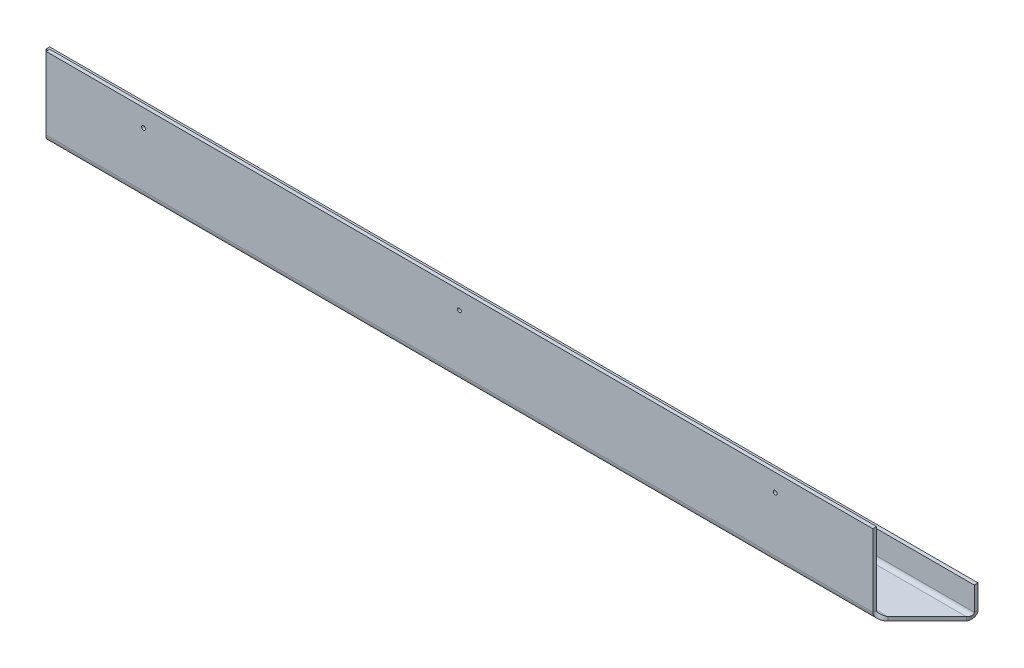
ISO-10303-21;
HEADER;
FILE_DESCRIPTION(('STEP AP214'),'2;1');
FILE_NAME('part.step','',(''),(''),'','','');
FILE_SCHEMA(('AUTOMOTIVE_DESIGN { 1 0 10303 214 1 1 1 1 }'));
ENDSEC;
DATA;
#1=APPLICATION_CONTEXT('core data for automotive mechanical design processes');
#2=APPLICATION_PROTOCOL_DEFINITION('international standard','automotive_design',2000,#1);
#3=PRODUCT_CONTEXT('',#1,'mechanical');
#4=PRODUCT('Part','Part','',(#3));
#5=PRODUCT_RELATED_PRODUCT_CATEGORY('part','',(#4));
#6=PRODUCT_DEFINITION_FORMATION('','',#4);
#7=PRODUCT_DEFINITION_CONTEXT('part definition',#1,'design');
#8=PRODUCT_DEFINITION('design','',#6,#7);
#9=PRODUCT_DEFINITION_SHAPE('','',#8);
#10=(LENGTH_UNIT() NAMED_UNIT(*) SI_UNIT(.MILLI.,.METRE.));
#11=(NAMED_UNIT(*) PLANE_ANGLE_UNIT() SI_UNIT($,.RADIAN.));
#12=(NAMED_UNIT(*) SI_UNIT($,.STERADIAN.) SOLID_ANGLE_UNIT());
#13=UNCERTAINTY_MEASURE_WITH_UNIT(LENGTH_MEASURE(1.E-05),#10,'distance_accuracy_value','');
#14=(GEOMETRIC_REPRESENTATION_CONTEXT(3) GLOBAL_UNCERTAINTY_ASSIGNED_CONTEXT((#13)) GLOBAL_UNIT_ASSIGNED_CONTEXT((#10,
#11,#12)) REPRESENTATION_CONTEXT('',''));
#15=CARTESIAN_POINT('',(0.,0.,0.));
#16=DIRECTION('',(0.,0.,1.));
#17=DIRECTION('',(1.,0.,0.));
#18=AXIS2_PLACEMENT_3D('',#15,#16,#17);
#19=CARTESIAN_POINT('',(809.702271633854,3.048,0.));
#20=DIRECTION('',(0.,-1.,0.));
#21=DIRECTION('',(0.,0.,-1.));
#22=AXIS2_PLACEMENT_3D('',#19,#20,#21);
#23=PLANE('',#22);
#24=DIRECTION('',(0.707106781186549,0.,-0.707106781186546));
#25=VECTOR('',#24,1.);
#26=CARTESIAN_POINT('',(785.470135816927,3.048,-24.2321358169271));
#27=LINE('',#26,#25);
#28=CARTESIAN_POINT('',(723.138,3.048,38.1));
#29=VERTEX_POINT('',#28);
#30=CARTESIAN_POINT('',(755.015,3.048,6.223));
#31=VERTEX_POINT('',#30);
#32=EDGE_CURVE('E140',#29,#31,#27,.T.);
#33=ORIENTED_EDGE('',*,*,#32,.T.);
#34=DIRECTION('',(-1.,0.,0.));
#35=VECTOR('',#34,1.);
#36=CARTESIAN_POINT('',(809.702271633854,3.048,6.223));
#37=LINE('',#36,#35);
#38=CARTESIAN_POINT('',(6.22299999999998,3.048,6.22299999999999));
#39=VERTEX_POINT('',#38);
#40=EDGE_CURVE('E184',#31,#39,#37,.T.);
#41=ORIENTED_EDGE('',*,*,#40,.T.);
#42=DIRECTION('',(-0.707106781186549,0.,-0.707106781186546));
#43=VECTOR('',#42,1.);
#44=CARTESIAN_POINT('',(404.851135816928,3.04799999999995,404.851135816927));
#45=LINE('',#44,#43);
#46=CARTESIAN_POINT('',(38.1,3.048,38.1));
#47=VERTEX_POINT('',#46);
#48=EDGE_CURVE('E176',#47,#39,#45,.T.);
#49=ORIENTED_EDGE('',*,*,#48,.F.);
#50=DIRECTION('',(1.,0.,0.));
#51=VECTOR('',#50,1.);
#52=CARTESIAN_POINT('',(761.238,3.048,38.1));
#53=LINE('',#52,#51);
#54=EDGE_CURVE('E167',#29,#47,#53,.F.);
#55=ORIENTED_EDGE('',*,*,#54,.F.);
#56=EDGE_LOOP('',(#33,#41,#49,#55));
#57=FACE_BOUND('',#56,.T.);
#58=ADVANCED_FACE('F48',(#57),#23,.F.);
#59=CARTESIAN_POINT('',(809.702271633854,0.,0.));
#60=DIRECTION('',(0.,-1.,0.));
#61=DIRECTION('',(0.,0.,-1.));
#62=AXIS2_PLACEMENT_3D('',#59,#60,#61);
#63=PLANE('',#62);
#64=DIRECTION('',(-1.,0.,0.));
#65=VECTOR('',#64,1.);
#66=CARTESIAN_POINT('',(809.702271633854,0.,6.223));
#67=LINE('',#66,#65);
#68=CARTESIAN_POINT('',(755.015,0.,6.223));
#69=VERTEX_POINT('',#68);
#70=CARTESIAN_POINT('',(6.22299999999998,0.,6.22299999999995));
#71=VERTEX_POINT('',#70);
#72=EDGE_CURVE('E11',#69,#71,#67,.T.);
#73=ORIENTED_EDGE('',*,*,#72,.F.);
#74=DIRECTION('',(0.707106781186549,0.,-0.707106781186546));
#75=VECTOR('',#74,1.);
#76=CARTESIAN_POINT('',(785.470135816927,0.,-24.2321358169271));
#77=LINE('',#76,#75);
#78=CARTESIAN_POINT('',(723.138,0.,38.1));
#79=VERTEX_POINT('',#78);
#80=EDGE_CURVE('E151',#79,#69,#77,.T.);
#81=ORIENTED_EDGE('',*,*,#80,.F.);
#82=DIRECTION('',(1.,0.,0.));
#83=VECTOR('',#82,1.);
#84=CARTESIAN_POINT('',(761.238,0.,38.1));
#85=LINE('',#84,#83);
#86=CARTESIAN_POINT('',(38.1,0.,38.1));
#87=VERTEX_POINT('',#86);
#88=EDGE_CURVE('E178',#79,#87,#85,.F.);
#89=ORIENTED_EDGE('',*,*,#88,.T.);
#90=DIRECTION('',(-0.707106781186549,0.,-0.707106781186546));
#91=VECTOR('',#90,1.);
#92=CARTESIAN_POINT('',(404.851135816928,0.,404.851135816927));
#93=LINE('',#92,#91);
#94=EDGE_CURVE('E276',#87,#71,#93,.T.);
#95=ORIENTED_EDGE('',*,*,#94,.T.);
#96=EDGE_LOOP('',(#73,#81,#89,#95));
#97=FACE_BOUND('',#96,.T.);
#98=ADVANCED_FACE('F382',(#97),#63,.T.);
#99=CARTESIAN_POINT('',(809.702271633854,6.223,6.223));
#100=DIRECTION('',(-1.,0.,0.));
#101=DIRECTION('',(0.,0.,1.));
#102=AXIS2_PLACEMENT_3D('',#99,#100,#101);
#103=CYLINDRICAL_SURFACE('',#102,6.223);
#104=DIRECTION('',(-1.,0.,0.));
#105=VECTOR('',#104,1.);
#106=CARTESIAN_POINT('',(809.702271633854,6.223,0.));
#107=LINE('',#106,#105);
#108=CARTESIAN_POINT('',(758.19,6.223,0.));
#109=VERTEX_POINT('',#108);
#110=CARTESIAN_POINT('',(3.04800000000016,6.223,0.));
#111=VERTEX_POINT('',#110);
#112=EDGE_CURVE('E57',#109,#111,#107,.T.);
#113=ORIENTED_EDGE('',*,*,#112,.F.);
#114=CARTESIAN_POINT('',(755.015,6.223,6.223));
#115=DIRECTION('',(-0.890761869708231,0.,-0.454470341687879));
#116=DIRECTION('',(-0.454470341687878,0.,0.890761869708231));
#117=AXIS2_PLACEMENT_3D('',#114,#115,#116);
#118=ELLIPSE('',#117,6.98615445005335,6.223);
#119=EDGE_CURVE('E222',#69,#109,#118,.F.);
#120=ORIENTED_EDGE('',*,*,#119,.F.);
#121=ORIENTED_EDGE('',*,*,#72,.T.);
#122=CARTESIAN_POINT('',(6.22300000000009,6.223,6.223));
#123=DIRECTION('',(-0.890761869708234,0.,0.454470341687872));
#124=DIRECTION('',(-0.454470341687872,0.,-0.890761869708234));
#125=AXIS2_PLACEMENT_3D('',#122,#123,#124);
#126=ELLIPSE('',#125,6.98615445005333,6.223);
#127=EDGE_CURVE('E262',#71,#111,#126,.F.);
#128=ORIENTED_EDGE('',*,*,#127,.T.);
#129=EDGE_LOOP('',(#113,#120,#121,#128));
#130=FACE_BOUND('',#129,.T.);
#131=ADVANCED_FACE('F387',(#130),#103,.T.);
#132=CARTESIAN_POINT('',(809.702271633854,0.,0.));
#133=DIRECTION('',(0.,0.,-1.));
#134=DIRECTION('',(-1.,0.,0.));
#135=AXIS2_PLACEMENT_3D('',#132,#133,#134);
#136=PLANE('',#135);
#137=DIRECTION('',(-1.,0.,0.));
#138=VECTOR('',#137,1.);
#139=CARTESIAN_POINT('',(809.702271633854,25.4,0.));
#140=LINE('',#139,#138);
#141=CARTESIAN_POINT('',(758.19,25.4,0.));
#142=VERTEX_POINT('',#141);
#143=CARTESIAN_POINT('',(3.04799999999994,25.4,0.));
#144=VERTEX_POINT('',#143);
#145=EDGE_CURVE('E199',#142,#144,#140,.T.);
#146=ORIENTED_EDGE('',*,*,#145,.F.);
#147=DIRECTION('',(0.,1.,0.));
#148=VECTOR('',#147,1.);
#149=CARTESIAN_POINT('',(758.19,0.,0.));
#150=LINE('',#149,#148);
#151=EDGE_CURVE('E244',#109,#142,#150,.T.);
#152=ORIENTED_EDGE('',*,*,#151,.F.);
#153=ORIENTED_EDGE('',*,*,#112,.T.);
#154=DIRECTION('',(0.,1.,0.));
#155=VECTOR('',#154,1.);
#156=CARTESIAN_POINT('',(3.04800000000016,0.,0.));
#157=LINE('',#156,#155);
#158=EDGE_CURVE('E304',#111,#144,#157,.T.);
#159=ORIENTED_EDGE('',*,*,#158,.T.);
#160=EDGE_LOOP('',(#146,#152,#153,#159));
#161=FACE_BOUND('',#160,.T.);
#162=ADVANCED_FACE('F392',(#161),#136,.T.);
#163=CARTESIAN_POINT('',(809.702271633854,25.4,3.048));
#164=DIRECTION('',(0.,1.,0.));
#165=DIRECTION('',(0.,0.,1.));
#166=AXIS2_PLACEMENT_3D('',#163,#164,#165);
#167=PLANE('',#166);
#168=DIRECTION('',(-1.,0.,0.));
#169=VECTOR('',#168,1.);
#170=CARTESIAN_POINT('',(809.702271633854,25.4,3.048));
#171=LINE('',#170,#169);
#172=CARTESIAN_POINT('',(758.19,25.4,3.048));
#173=VERTEX_POINT('',#172);
#174=CARTESIAN_POINT('',(3.04799999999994,25.4,3.048));
#175=VERTEX_POINT('',#174);
#176=EDGE_CURVE('E196',#173,#175,#171,.T.);
#177=ORIENTED_EDGE('',*,*,#176,.F.);
#178=DIRECTION('',(0.,0.,1.));
#179=VECTOR('',#178,1.);
#180=CARTESIAN_POINT('',(758.19,25.4,3.048));
#181=LINE('',#180,#179);
#182=EDGE_CURVE('E238',#173,#142,#181,.F.);
#183=ORIENTED_EDGE('',*,*,#182,.T.);
#184=ORIENTED_EDGE('',*,*,#145,.T.);
#185=DIRECTION('',(0.,0.,1.));
#186=VECTOR('',#185,1.);
#187=CARTESIAN_POINT('',(3.04799999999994,25.4,3.048));
#188=LINE('',#187,#186);
#189=EDGE_CURVE('E312',#175,#144,#188,.F.);
#190=ORIENTED_EDGE('',*,*,#189,.F.);
#191=EDGE_LOOP('',(#177,#183,#184,#190));
#192=FACE_BOUND('',#191,.T.);
#193=ADVANCED_FACE('F399',(#192),#167,.T.);
#194=CARTESIAN_POINT('',(809.702271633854,0.,3.048));
#195=DIRECTION('',(0.,0.,-1.));
#196=DIRECTION('',(-1.,0.,0.));
#197=AXIS2_PLACEMENT_3D('',#194,#195,#196);
#198=PLANE('',#197);
#199=DIRECTION('',(0.,1.,0.));
#200=VECTOR('',#199,1.);
#201=CARTESIAN_POINT('',(758.19,0.,3.048));
#202=LINE('',#201,#200);
#203=CARTESIAN_POINT('',(758.19,6.223,3.048));
#204=VERTEX_POINT('',#203);
#205=EDGE_CURVE('E172',#204,#173,#202,.T.);
#206=ORIENTED_EDGE('',*,*,#205,.T.);
#207=ORIENTED_EDGE('',*,*,#176,.T.);
#208=DIRECTION('',(0.,1.,0.));
#209=VECTOR('',#208,1.);
#210=CARTESIAN_POINT('',(3.04799999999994,-1.01707239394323E-13,3.048));
#211=LINE('',#210,#209);
#212=CARTESIAN_POINT('',(3.04800000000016,6.223,3.048));
#213=VERTEX_POINT('',#212);
#214=EDGE_CURVE('E288',#213,#175,#211,.T.);
#215=ORIENTED_EDGE('',*,*,#214,.F.);
#216=DIRECTION('',(-1.,0.,0.));
#217=VECTOR('',#216,1.);
#218=CARTESIAN_POINT('',(809.702271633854,6.223,3.048));
#219=LINE('',#218,#217);
#220=EDGE_CURVE('E193',#204,#213,#219,.T.);
#221=ORIENTED_EDGE('',*,*,#220,.F.);
#222=EDGE_LOOP('',(#206,#207,#215,#221));
#223=FACE_BOUND('',#222,.T.);
#224=ADVANCED_FACE('F403',(#223),#198,.F.);
#225=CARTESIAN_POINT('',(809.702271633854,6.223,6.223));
#226=DIRECTION('',(-1.,0.,0.));
#227=DIRECTION('',(0.,0.,1.));
#228=AXIS2_PLACEMENT_3D('',#225,#226,#227);
#229=CYLINDRICAL_SURFACE('',#228,3.175);
#230=CARTESIAN_POINT('',(755.015,6.223,6.223));
#231=DIRECTION('',(-0.707106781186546,0.,-0.707106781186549));
#232=DIRECTION('',(-0.707106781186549,0.,0.707106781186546));
#233=AXIS2_PLACEMENT_3D('',#230,#231,#232);
#234=ELLIPSE('',#233,4.49012806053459,3.175);
#235=EDGE_CURVE('E216',#31,#204,#234,.F.);
#236=ORIENTED_EDGE('',*,*,#235,.T.);
#237=ORIENTED_EDGE('',*,*,#220,.T.);
#238=CARTESIAN_POINT('',(6.22300000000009,6.223,6.223));
#239=DIRECTION('',(-0.707106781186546,0.,0.707106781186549));
#240=DIRECTION('',(-0.707106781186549,0.,-0.707106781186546));
#241=AXIS2_PLACEMENT_3D('',#238,#239,#240);
#242=ELLIPSE('',#241,4.49012806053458,3.175);
#243=EDGE_CURVE('E266',#39,#213,#242,.F.);
#244=ORIENTED_EDGE('',*,*,#243,.F.);
#245=ORIENTED_EDGE('',*,*,#40,.F.);
#246=EDGE_LOOP('',(#236,#237,#244,#245));
#247=FACE_BOUND('',#246,.T.);
#248=ADVANCED_FACE('F407',(#247),#229,.F.);
#249=CARTESIAN_POINT('',(761.238,6.223,38.1));
#250=DIRECTION('',(1.,0.,0.));
#251=DIRECTION('',(0.,0.,1.));
#252=AXIS2_PLACEMENT_3D('',#249,#250,#251);
#253=CYLINDRICAL_SURFACE('',#252,6.223);
#254=ORIENTED_EDGE('',*,*,#88,.F.);
#255=CARTESIAN_POINT('',(723.138,6.223,38.1));
#256=DIRECTION('',(-0.707106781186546,0.,-0.707106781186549));
#257=DIRECTION('',(0.707106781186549,0.,-0.707106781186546));
#258=AXIS2_PLACEMENT_3D('',#255,#256,#257);
#259=ELLIPSE('',#258,8.8006509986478,6.223);
#260=CARTESIAN_POINT('',(716.915,6.22300000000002,44.323));
#261=VERTEX_POINT('',#260);
#262=EDGE_CURVE('E159',#261,#79,#259,.F.);
#263=ORIENTED_EDGE('',*,*,#262,.F.);
#264=DIRECTION('',(1.,0.,0.));
#265=VECTOR('',#264,1.);
#266=CARTESIAN_POINT('',(0.,6.22299999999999,44.323));
#267=LINE('',#266,#265);
#268=CARTESIAN_POINT('',(44.3230000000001,6.223,44.323));
#269=VERTEX_POINT('',#268);
#270=EDGE_CURVE('E321',#269,#261,#267,.T.);
#271=ORIENTED_EDGE('',*,*,#270,.F.);
#272=CARTESIAN_POINT('',(38.1,6.223,38.1));
#273=DIRECTION('',(-0.707106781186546,0.,0.707106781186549));
#274=DIRECTION('',(0.707106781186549,0.,0.707106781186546));
#275=AXIS2_PLACEMENT_3D('',#272,#273,#274);
#276=ELLIPSE('',#275,8.80065099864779,6.223);
#277=EDGE_CURVE('E260',#269,#87,#276,.F.);
#278=ORIENTED_EDGE('',*,*,#277,.T.);
#279=EDGE_LOOP('',(#254,#263,#271,#278));
#280=FACE_BOUND('',#279,.T.);
#281=ADVANCED_FACE('F339',(#280),#253,.T.);
#282=CARTESIAN_POINT('',(761.238,6.223,38.1));
#283=DIRECTION('',(1.,0.,0.));
#284=DIRECTION('',(0.,0.,1.));
#285=AXIS2_PLACEMENT_3D('',#282,#283,#284);
#286=CYLINDRICAL_SURFACE('',#285,3.175);
#287=CARTESIAN_POINT('',(723.138,6.223,38.1));
#288=DIRECTION('',(-0.454470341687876,0.,-0.890761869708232));
#289=DIRECTION('',(0.890761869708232,0.,-0.454470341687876));
#290=AXIS2_PLACEMENT_3D('',#287,#288,#289);
#291=ELLIPSE('',#290,6.98615445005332,3.175);
#292=CARTESIAN_POINT('',(716.915,6.22300000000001,41.275));
#293=VERTEX_POINT('',#292);
#294=EDGE_CURVE('E157',#293,#29,#291,.F.);
#295=ORIENTED_EDGE('',*,*,#294,.T.);
#296=ORIENTED_EDGE('',*,*,#54,.T.);
#297=CARTESIAN_POINT('',(38.1,6.223,38.1));
#298=DIRECTION('',(-0.454470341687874,0.,0.890761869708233));
#299=DIRECTION('',(0.890761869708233,0.,0.454470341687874));
#300=AXIS2_PLACEMENT_3D('',#297,#298,#299);
#301=ELLIPSE('',#300,6.98615445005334,3.175);
#302=CARTESIAN_POINT('',(44.3230000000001,6.22300000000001,41.275));
#303=VERTEX_POINT('',#302);
#304=EDGE_CURVE('E270',#303,#47,#301,.F.);
#305=ORIENTED_EDGE('',*,*,#304,.F.);
#306=DIRECTION('',(1.,0.,0.));
#307=VECTOR('',#306,1.);
#308=CARTESIAN_POINT('',(0.,6.22299999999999,41.275));
#309=LINE('',#308,#307);
#310=EDGE_CURVE('E170',#303,#293,#309,.T.);
#311=ORIENTED_EDGE('',*,*,#310,.T.);
#312=EDGE_LOOP('',(#295,#296,#305,#311));
#313=FACE_BOUND('',#312,.T.);
#314=ADVANCED_FACE('F165',(#313),#286,.F.);
#315=CARTESIAN_POINT('',(0.,-1.58753050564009E-13,44.323));
#316=DIRECTION('',(0.,0.,1.));
#317=DIRECTION('',(0.,-1.,0.));
#318=AXIS2_PLACEMENT_3D('',#315,#316,#317);
#319=PLANE('',#318);
#320=CARTESIAN_POINT('',(123.698,50.8,44.323));
#321=DIRECTION('',(0.,0.,1.));
#322=DIRECTION('',(1.,0.,0.));
#323=AXIS2_PLACEMENT_3D('',#320,#321,#322);
#324=CIRCLE('',#323,1.58749999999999);
#325=CARTESIAN_POINT('',(125.2855,50.8,44.323));
#326=VERTEX_POINT('',#325);
#327=EDGE_CURVE('E208',#326,#326,#324,.T.);
#328=ORIENTED_EDGE('',*,*,#327,.F.);
#329=EDGE_LOOP('',(#328));
#330=FACE_BOUND('',#329,.T.);
#331=CARTESIAN_POINT('',(380.619,50.8,44.323));
#332=DIRECTION('',(0.,0.,1.));
#333=DIRECTION('',(1.,0.,0.));
#334=AXIS2_PLACEMENT_3D('',#331,#332,#333);
#335=CIRCLE('',#334,1.58750000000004);
#336=CARTESIAN_POINT('',(382.2065,50.8,44.323));
#337=VERTEX_POINT('',#336);
#338=EDGE_CURVE('E347',#337,#337,#335,.T.);
#339=ORIENTED_EDGE('',*,*,#338,.F.);
#340=EDGE_LOOP('',(#339));
#341=FACE_BOUND('',#340,.T.);
#342=CARTESIAN_POINT('',(637.54,50.8,44.323));
#343=DIRECTION('',(0.,0.,1.));
#344=DIRECTION('',(1.,0.,0.));
#345=AXIS2_PLACEMENT_3D('',#342,#343,#344);
#346=CIRCLE('',#345,1.58749999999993);
#347=CARTESIAN_POINT('',(639.1275,50.8,44.323));
#348=VERTEX_POINT('',#347);
#349=EDGE_CURVE('E343',#348,#348,#346,.T.);
#350=ORIENTED_EDGE('',*,*,#349,.F.);
#351=EDGE_LOOP('',(#350));
#352=FACE_BOUND('',#351,.T.);
#353=ORIENTED_EDGE('',*,*,#270,.T.);
#354=DIRECTION('',(0.,1.,0.));
#355=VECTOR('',#354,1.);
#356=CARTESIAN_POINT('',(716.915,-956.645396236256,44.3229999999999));
#357=LINE('',#356,#355);
#358=CARTESIAN_POINT('',(716.915,65.0875000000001,44.323));
#359=VERTEX_POINT('',#358);
#360=EDGE_CURVE('E234',#261,#359,#357,.T.);
#361=ORIENTED_EDGE('',*,*,#360,.T.);
#362=DIRECTION('',(1.,0.,0.));
#363=VECTOR('',#362,1.);
#364=CARTESIAN_POINT('',(761.238,65.0875,44.3230000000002));
#365=LINE('',#364,#363);
#366=CARTESIAN_POINT('',(44.3230000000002,65.0875,44.3230000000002));
#367=VERTEX_POINT('',#366);
#368=EDGE_CURVE('E179',#367,#359,#365,.T.);
#369=ORIENTED_EDGE('',*,*,#368,.F.);
#370=DIRECTION('',(0.,1.,0.));
#371=VECTOR('',#370,1.);
#372=CARTESIAN_POINT('',(44.3230000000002,-960.435092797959,44.3229999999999));
#373=LINE('',#372,#371);
#374=EDGE_CURVE('E73',#269,#367,#373,.T.);
#375=ORIENTED_EDGE('',*,*,#374,.F.);
#376=EDGE_LOOP('',(#353,#361,#369,#375));
#377=FACE_BOUND('',#376,.T.);
#378=ADVANCED_FACE('F335',(#330,#341,#352,#377),#319,.T.);
#379=CARTESIAN_POINT('',(0.,-1.47726707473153E-13,41.275));
#380=DIRECTION('',(0.,0.,1.));
#381=DIRECTION('',(0.,-1.,0.));
#382=AXIS2_PLACEMENT_3D('',#379,#380,#381);
#383=PLANE('',#382);
#384=CARTESIAN_POINT('',(123.698,50.8,41.2750000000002));
#385=DIRECTION('',(0.,0.,1.));
#386=DIRECTION('',(0.,-1.,0.));
#387=AXIS2_PLACEMENT_3D('',#384,#385,#386);
#388=CIRCLE('',#387,1.58749999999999);
#389=CARTESIAN_POINT('',(123.698,49.2125,41.2750000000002));
#390=VERTEX_POINT('',#389);
#391=EDGE_CURVE('E51',#390,#390,#388,.T.);
#392=ORIENTED_EDGE('',*,*,#391,.T.);
#393=EDGE_LOOP('',(#392));
#394=FACE_BOUND('',#393,.T.);
#395=CARTESIAN_POINT('',(380.619,50.8,41.2750000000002));
#396=DIRECTION('',(0.,0.,1.));
#397=DIRECTION('',(0.,-1.,0.));
#398=AXIS2_PLACEMENT_3D('',#395,#396,#397);
#399=CIRCLE('',#398,1.58750000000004);
#400=CARTESIAN_POINT('',(380.619,49.2124999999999,41.2750000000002));
#401=VERTEX_POINT('',#400);
#402=EDGE_CURVE('E207',#401,#401,#399,.T.);
#403=ORIENTED_EDGE('',*,*,#402,.T.);
#404=EDGE_LOOP('',(#403));
#405=FACE_BOUND('',#404,.T.);
#406=CARTESIAN_POINT('',(637.54,50.8,41.2750000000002));
#407=DIRECTION('',(0.,0.,1.));
#408=DIRECTION('',(0.,-1.,0.));
#409=AXIS2_PLACEMENT_3D('',#406,#407,#408);
#410=CIRCLE('',#409,1.58749999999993);
#411=CARTESIAN_POINT('',(637.54,49.2125,41.2750000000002));
#412=VERTEX_POINT('',#411);
#413=EDGE_CURVE('E204',#412,#412,#410,.T.);
#414=ORIENTED_EDGE('',*,*,#413,.T.);
#415=EDGE_LOOP('',(#414));
#416=FACE_BOUND('',#415,.T.);
#417=DIRECTION('',(0.,-1.,0.));
#418=VECTOR('',#417,1.);
#419=CARTESIAN_POINT('',(716.915,-1.47844001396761E-13,41.275));
#420=LINE('',#419,#418);
#421=CARTESIAN_POINT('',(716.915,65.0875,41.2750000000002));
#422=VERTEX_POINT('',#421);
#423=EDGE_CURVE('E65',#293,#422,#420,.F.);
#424=ORIENTED_EDGE('',*,*,#423,.F.);
#425=ORIENTED_EDGE('',*,*,#310,.F.);
#426=DIRECTION('',(0.,-1.,0.));
#427=VECTOR('',#426,1.);
#428=CARTESIAN_POINT('',(44.3230000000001,-1.47844001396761E-13,41.275));
#429=LINE('',#428,#427);
#430=CARTESIAN_POINT('',(44.3230000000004,65.0875,41.2750000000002));
#431=VERTEX_POINT('',#430);
#432=EDGE_CURVE('E292',#303,#431,#429,.F.);
#433=ORIENTED_EDGE('',*,*,#432,.T.);
#434=DIRECTION('',(1.,0.,0.));
#435=VECTOR('',#434,1.);
#436=CARTESIAN_POINT('',(761.238,65.0875,41.2750000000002));
#437=LINE('',#436,#435);
#438=EDGE_CURVE('E187',#431,#422,#437,.T.);
#439=ORIENTED_EDGE('',*,*,#438,.T.);
#440=EDGE_LOOP('',(#424,#425,#433,#439));
#441=FACE_BOUND('',#440,.T.);
#442=ADVANCED_FACE('F329',(#394,#405,#416,#441),#383,.F.);
#443=CARTESIAN_POINT('',(761.238,65.0875,44.3230000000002));
#444=DIRECTION('',(0.,1.,0.));
#445=DIRECTION('',(0.,0.,1.));
#446=AXIS2_PLACEMENT_3D('',#443,#444,#445);
#447=PLANE('',#446);
#448=ORIENTED_EDGE('',*,*,#368,.T.);
#449=DIRECTION('',(0.,0.,1.));
#450=VECTOR('',#449,1.);
#451=CARTESIAN_POINT('',(716.915,65.0875000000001,44.323));
#452=LINE('',#451,#450);
#453=EDGE_CURVE('E233',#359,#422,#452,.F.);
#454=ORIENTED_EDGE('',*,*,#453,.T.);
#455=ORIENTED_EDGE('',*,*,#438,.F.);
#456=DIRECTION('',(0.,0.,1.));
#457=VECTOR('',#456,1.);
#458=CARTESIAN_POINT('',(44.3230000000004,65.0875,44.3230000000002));
#459=LINE('',#458,#457);
#460=EDGE_CURVE('E296',#367,#431,#459,.F.);
#461=ORIENTED_EDGE('',*,*,#460,.F.);
#462=EDGE_LOOP('',(#448,#454,#455,#461));
#463=FACE_BOUND('',#462,.T.);
#464=ADVANCED_FACE('F331',(#463),#447,.T.);
#465=CARTESIAN_POINT('',(3.04799999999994,-1.01707239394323E-13,3.048));
#466=DIRECTION('',(-1.,0.,0.));
#467=DIRECTION('',(0.,1.,0.));
#468=AXIS2_PLACEMENT_3D('',#465,#466,#467);
#469=PLANE('',#468);
#470=ORIENTED_EDGE('',*,*,#214,.T.);
#471=ORIENTED_EDGE('',*,*,#189,.T.);
#472=ORIENTED_EDGE('',*,*,#158,.F.);
#473=DIRECTION('',(0.,0.,1.));
#474=VECTOR('',#473,1.);
#475=CARTESIAN_POINT('',(3.04800000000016,6.223,3.048));
#476=LINE('',#475,#474);
#477=EDGE_CURVE('E308',#213,#111,#476,.F.);
#478=ORIENTED_EDGE('',*,*,#477,.F.);
#479=EDGE_LOOP('',(#470,#471,#472,#478));
#480=FACE_BOUND('',#479,.T.);
#481=ADVANCED_FACE('F379',(#480),#469,.T.);
#482=CARTESIAN_POINT('',(44.3230000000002,-960.435092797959,44.3229999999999));
#483=DIRECTION('',(1.,0.,0.));
#484=DIRECTION('',(0.,1.,0.));
#485=AXIS2_PLACEMENT_3D('',#482,#483,#484);
#486=PLANE('',#485);
#487=DIRECTION('',(0.,0.,1.));
#488=VECTOR('',#487,1.);
#489=CARTESIAN_POINT('',(44.3230000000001,6.223,44.323));
#490=LINE('',#489,#488);
#491=EDGE_CURVE('E283',#269,#303,#490,.F.);
#492=ORIENTED_EDGE('',*,*,#491,.F.);
#493=ORIENTED_EDGE('',*,*,#374,.T.);
#494=ORIENTED_EDGE('',*,*,#460,.T.);
#495=ORIENTED_EDGE('',*,*,#432,.F.);
#496=EDGE_LOOP('',(#492,#493,#494,#495));
#497=FACE_BOUND('',#496,.T.);
#498=ADVANCED_FACE('F515',(#497),#486,.F.);
#499=CARTESIAN_POINT('',(44.3230000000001,6.223,44.323));
#500=CARTESIAN_POINT('',(44.323,6.223,43.307));
#501=CARTESIAN_POINT('',(44.323,6.223,42.291));
#502=CARTESIAN_POINT('',(44.323,6.223,41.275));
#503=CARTESIAN_POINT('',(44.3230000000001,-6.223,44.323));
#504=CARTESIAN_POINT('',(44.323,-4.191,43.307));
#505=CARTESIAN_POINT('',(44.323,-2.159,42.291));
#506=CARTESIAN_POINT('',(44.323,-0.127000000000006,41.275));
#507=CARTESIAN_POINT('',(31.877,-6.223,31.877));
#508=CARTESIAN_POINT('',(31.877,-4.191,32.893));
#509=CARTESIAN_POINT('',(31.877,-2.159,33.909));
#510=CARTESIAN_POINT('',(31.877,-0.127000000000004,34.925));
#511=CARTESIAN_POINT('',(31.877,6.223,31.877));
#512=CARTESIAN_POINT('',(31.877,6.223,32.893));
#513=CARTESIAN_POINT('',(31.877,6.223,33.909));
#514=CARTESIAN_POINT('',(31.877,6.223,34.925));
#515=CARTESIAN_POINT('',(31.877,18.669,31.877));
#516=CARTESIAN_POINT('',(31.877,16.637,32.893));
#517=CARTESIAN_POINT('',(31.877,14.605,33.909));
#518=CARTESIAN_POINT('',(31.877,12.573,34.925));
#519=CARTESIAN_POINT('',(44.3230000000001,18.669,44.323));
#520=CARTESIAN_POINT('',(44.323,16.637,43.307));
#521=CARTESIAN_POINT('',(44.323,14.605,42.291));
#522=CARTESIAN_POINT('',(44.323,12.573,41.275));
#523=CARTESIAN_POINT('',(44.3230000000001,6.223,44.323));
#524=CARTESIAN_POINT('',(44.323,6.223,43.307));
#525=CARTESIAN_POINT('',(44.323,6.223,42.291));
#526=CARTESIAN_POINT('',(44.323,6.223,41.275));
#527=(BOUNDED_SURFACE() B_SPLINE_SURFACE(3,3,((#499,#500,#501,#502),(#503,#504,#505,#506),(#507,
#508,#509,#510),(#511,#512,#513,#514),(#515,#516,#517,#518),(#519,#520,#521,#522),(#523,#524,
#525,#526)),.UNSPECIFIED.,.T.,.F.,.F.) B_SPLINE_SURFACE_WITH_KNOTS((4,3,4),(4,4),(0.,0.5,1.),
(0.,1.),.UNSPECIFIED.) GEOMETRIC_REPRESENTATION_ITEM() RATIONAL_B_SPLINE_SURFACE(((1.,1.,1.,1.),
(0.333333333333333,0.333333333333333,0.333333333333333,0.333333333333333),(0.333333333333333,
0.333333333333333,0.333333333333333,0.333333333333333),(1.,1.,1.,1.),(0.333333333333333,
0.333333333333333,0.333333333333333,0.333333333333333),(0.333333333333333,0.333333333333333,
0.333333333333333,0.333333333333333),(1.,1.,1.,1.))) REPRESENTATION_ITEM('') SURFACE());
#528=DIRECTION('',(0.,1.,0.));
#529=VECTOR('',#528,1.);
#530=CARTESIAN_POINT('',(38.1,3.048,38.1));
#531=LINE('',#530,#529);
#532=EDGE_CURVE('E280',#47,#87,#531,.F.);
#533=ORIENTED_EDGE('',*,*,#532,.T.);
#534=ORIENTED_EDGE('',*,*,#277,.F.);
#535=ORIENTED_EDGE('',*,*,#491,.T.);
#536=ORIENTED_EDGE('',*,*,#304,.T.);
#537=EDGE_LOOP('',(#533,#534,#535,#536));
#538=FACE_BOUND('',#537,.T.);
#539=ADVANCED_FACE('F504',(#538),#527,.F.);
#540=CARTESIAN_POINT('',(404.851135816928,3.04799999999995,404.851135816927));
#541=DIRECTION('',(-0.707106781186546,0.,0.707106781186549));
#542=DIRECTION('',(-0.707106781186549,0.,-0.707106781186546));
#543=AXIS2_PLACEMENT_3D('',#540,#541,#542);
#544=PLANE('',#543);
#545=ORIENTED_EDGE('',*,*,#48,.T.);
#546=DIRECTION('',(0.,1.,0.));
#547=VECTOR('',#546,1.);
#548=CARTESIAN_POINT('',(6.22299999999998,3.048,6.22299999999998));
#549=LINE('',#548,#547);
#550=EDGE_CURVE('E284',#39,#71,#549,.F.);
#551=ORIENTED_EDGE('',*,*,#550,.T.);
#552=ORIENTED_EDGE('',*,*,#94,.F.);
#553=ORIENTED_EDGE('',*,*,#532,.F.);
#554=EDGE_LOOP('',(#545,#551,#552,#553));
#555=FACE_BOUND('',#554,.T.);
#556=ADVANCED_FACE('F493',(#555),#544,.T.);
#557=CARTESIAN_POINT('',(3.04800000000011,6.223,0.));
#558=CARTESIAN_POINT('',(3.0480000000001,6.223,1.016));
#559=CARTESIAN_POINT('',(3.04800000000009,6.223,2.032));
#560=CARTESIAN_POINT('',(3.04800000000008,6.223,3.048));
#561=CARTESIAN_POINT('',(3.0480000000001,18.669,0.));
#562=CARTESIAN_POINT('',(3.0480000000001,16.637,1.016));
#563=CARTESIAN_POINT('',(3.04800000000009,14.605,2.032));
#564=CARTESIAN_POINT('',(3.04800000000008,12.573,3.048));
#565=CARTESIAN_POINT('',(9.39800000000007,18.669,12.446));
#566=CARTESIAN_POINT('',(9.39800000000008,16.637,11.43));
#567=CARTESIAN_POINT('',(9.3980000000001,14.605,10.414));
#568=CARTESIAN_POINT('',(9.3980000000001,12.573,9.398));
#569=CARTESIAN_POINT('',(9.39800000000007,6.223,12.446));
#570=CARTESIAN_POINT('',(9.39800000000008,6.223,11.43));
#571=CARTESIAN_POINT('',(9.39800000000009,6.223,10.414));
#572=CARTESIAN_POINT('',(9.3980000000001,6.223,9.398));
#573=CARTESIAN_POINT('',(9.39800000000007,-6.223,12.446));
#574=CARTESIAN_POINT('',(9.39800000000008,-4.191,11.43));
#575=CARTESIAN_POINT('',(9.3980000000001,-2.159,10.414));
#576=CARTESIAN_POINT('',(9.3980000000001,-0.127000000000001,9.398));
#577=CARTESIAN_POINT('',(3.04800000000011,-6.223,0.));
#578=CARTESIAN_POINT('',(3.0480000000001,-4.191,1.016));
#579=CARTESIAN_POINT('',(3.04800000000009,-2.159,2.032));
#580=CARTESIAN_POINT('',(3.04800000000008,-0.127000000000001,3.048));
#581=CARTESIAN_POINT('',(3.04800000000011,6.223,0.));
#582=CARTESIAN_POINT('',(3.0480000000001,6.223,1.016));
#583=CARTESIAN_POINT('',(3.04800000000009,6.223,2.032));
#584=CARTESIAN_POINT('',(3.04800000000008,6.223,3.048));
#585=(BOUNDED_SURFACE() B_SPLINE_SURFACE(3,3,((#557,#558,#559,#560),(#561,#562,#563,#564),(#565,
#566,#567,#568),(#569,#570,#571,#572),(#573,#574,#575,#576),(#577,#578,#579,#580),(#581,#582,
#583,#584)),.UNSPECIFIED.,.T.,.F.,.F.) B_SPLINE_SURFACE_WITH_KNOTS((4,3,4),(4,4),(0.,0.5,1.),
(0.,1.),.UNSPECIFIED.) GEOMETRIC_REPRESENTATION_ITEM() RATIONAL_B_SPLINE_SURFACE(((1.,1.,1.,1.),
(0.333333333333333,0.333333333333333,0.333333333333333,0.333333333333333),(0.333333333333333,
0.333333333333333,0.333333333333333,0.333333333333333),(1.,1.,1.,1.),(0.333333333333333,
0.333333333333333,0.333333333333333,0.333333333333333),(0.333333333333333,0.333333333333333,
0.333333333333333,0.333333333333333),(1.,1.,1.,1.))) REPRESENTATION_ITEM('') SURFACE());
#586=ORIENTED_EDGE('',*,*,#243,.T.);
#587=ORIENTED_EDGE('',*,*,#477,.T.);
#588=ORIENTED_EDGE('',*,*,#127,.F.);
#589=ORIENTED_EDGE('',*,*,#550,.F.);
#590=EDGE_LOOP('',(#586,#587,#588,#589));
#591=FACE_BOUND('',#590,.T.);
#592=ADVANCED_FACE('F437',(#591),#585,.F.);
#593=CARTESIAN_POINT('',(785.470135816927,0.,-24.2321358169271));
#594=DIRECTION('',(-0.707106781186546,0.,-0.707106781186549));
#595=DIRECTION('',(0.707106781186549,0.,-0.707106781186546));
#596=AXIS2_PLACEMENT_3D('',#593,#594,#595);
#597=PLANE('',#596);
#598=ORIENTED_EDGE('',*,*,#80,.T.);
#599=DIRECTION('',(0.,-1.,0.));
#600=VECTOR('',#599,1.);
#601=CARTESIAN_POINT('',(755.015,0.,6.223));
#602=LINE('',#601,#600);
#603=EDGE_CURVE('E146',#69,#31,#602,.F.);
#604=ORIENTED_EDGE('',*,*,#603,.T.);
#605=ORIENTED_EDGE('',*,*,#32,.F.);
#606=DIRECTION('',(0.,-1.,0.));
#607=VECTOR('',#606,1.);
#608=CARTESIAN_POINT('',(723.138,0.,38.1));
#609=LINE('',#608,#607);
#610=EDGE_CURVE('E144',#79,#29,#609,.F.);
#611=ORIENTED_EDGE('',*,*,#610,.F.);
#612=EDGE_LOOP('',(#598,#604,#605,#611));
#613=FACE_BOUND('',#612,.T.);
#614=ADVANCED_FACE('F143',(#613),#597,.F.);
#615=CARTESIAN_POINT('',(716.915,-956.645396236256,44.3229999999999));
#616=DIRECTION('',(1.,0.,0.));
#617=DIRECTION('',(0.,1.,0.));
#618=AXIS2_PLACEMENT_3D('',#615,#616,#617);
#619=PLANE('',#618);
#620=ORIENTED_EDGE('',*,*,#360,.F.);
#621=DIRECTION('',(0.,0.,1.));
#622=VECTOR('',#621,1.);
#623=CARTESIAN_POINT('',(716.915,6.22300000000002,44.323));
#624=LINE('',#623,#622);
#625=EDGE_CURVE('E239',#261,#293,#624,.F.);
#626=ORIENTED_EDGE('',*,*,#625,.T.);
#627=ORIENTED_EDGE('',*,*,#423,.T.);
#628=ORIENTED_EDGE('',*,*,#453,.F.);
#629=EDGE_LOOP('',(#620,#626,#627,#628));
#630=FACE_BOUND('',#629,.T.);
#631=ADVANCED_FACE('F333',(#630),#619,.T.);
#632=CARTESIAN_POINT('',(729.361,6.223,31.877));
#633=CARTESIAN_POINT('',(729.361,6.223,32.893));
#634=CARTESIAN_POINT('',(729.361,6.223,33.909));
#635=CARTESIAN_POINT('',(729.361,6.223,34.925));
#636=CARTESIAN_POINT('',(729.361,18.669,31.877));
#637=CARTESIAN_POINT('',(729.361,16.637,32.893));
#638=CARTESIAN_POINT('',(729.361,14.605,33.909));
#639=CARTESIAN_POINT('',(729.361,12.573,34.925));
#640=CARTESIAN_POINT('',(716.915,18.669,44.323));
#641=CARTESIAN_POINT('',(716.915,16.637,43.307));
#642=CARTESIAN_POINT('',(716.915,14.605,42.291));
#643=CARTESIAN_POINT('',(716.915,12.573,41.275));
#644=CARTESIAN_POINT('',(716.915,6.223,44.323));
#645=CARTESIAN_POINT('',(716.915,6.223,43.307));
#646=CARTESIAN_POINT('',(716.915,6.223,42.291));
#647=CARTESIAN_POINT('',(716.915,6.223,41.275));
#648=CARTESIAN_POINT('',(716.915,-6.22300000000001,44.323));
#649=CARTESIAN_POINT('',(716.915,-4.19100000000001,43.307));
#650=CARTESIAN_POINT('',(716.915,-2.15900000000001,42.291));
#651=CARTESIAN_POINT('',(716.915,-0.127000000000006,41.275));
#652=CARTESIAN_POINT('',(729.361,-6.223,31.877));
#653=CARTESIAN_POINT('',(729.361,-4.19100000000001,32.893));
#654=CARTESIAN_POINT('',(729.361,-2.15900000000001,33.909));
#655=CARTESIAN_POINT('',(729.361,-0.127000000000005,34.925));
#656=CARTESIAN_POINT('',(729.361,6.223,31.877));
#657=CARTESIAN_POINT('',(729.361,6.223,32.893));
#658=CARTESIAN_POINT('',(729.361,6.223,33.909));
#659=CARTESIAN_POINT('',(729.361,6.223,34.925));
#660=(BOUNDED_SURFACE() B_SPLINE_SURFACE(3,3,((#632,#633,#634,#635),(#636,#637,#638,#639),(#640,
#641,#642,#643),(#644,#645,#646,#647),(#648,#649,#650,#651),(#652,#653,#654,#655),(#656,#657,
#658,#659)),.UNSPECIFIED.,.T.,.F.,.F.) B_SPLINE_SURFACE_WITH_KNOTS((4,3,4),(4,4),(0.,0.5,1.),
(0.,1.),.UNSPECIFIED.) GEOMETRIC_REPRESENTATION_ITEM() RATIONAL_B_SPLINE_SURFACE(((1.,1.,1.,1.),
(0.333333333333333,0.333333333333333,0.333333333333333,0.333333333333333),(0.333333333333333,
0.333333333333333,0.333333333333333,0.333333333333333),(1.,1.,1.,1.),(0.333333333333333,
0.333333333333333,0.333333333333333,0.333333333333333),(0.333333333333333,0.333333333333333,
0.333333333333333,0.333333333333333),(1.,1.,1.,1.))) REPRESENTATION_ITEM('') SURFACE());
#661=ORIENTED_EDGE('',*,*,#262,.T.);
#662=ORIENTED_EDGE('',*,*,#610,.T.);
#663=ORIENTED_EDGE('',*,*,#294,.F.);
#664=ORIENTED_EDGE('',*,*,#625,.F.);
#665=EDGE_LOOP('',(#661,#662,#663,#664));
#666=FACE_BOUND('',#665,.T.);
#667=ADVANCED_FACE('F155',(#666),#660,.T.);
#668=CARTESIAN_POINT('',(758.19,0.,3.048));
#669=DIRECTION('',(-1.,0.,0.));
#670=DIRECTION('',(0.,1.,0.));
#671=AXIS2_PLACEMENT_3D('',#668,#669,#670);
#672=PLANE('',#671);
#673=ORIENTED_EDGE('',*,*,#182,.F.);
#674=ORIENTED_EDGE('',*,*,#205,.F.);
#675=DIRECTION('',(0.,0.,1.));
#676=VECTOR('',#675,1.);
#677=CARTESIAN_POINT('',(758.19,6.223,3.048));
#678=LINE('',#677,#676);
#679=EDGE_CURVE('E247',#204,#109,#678,.F.);
#680=ORIENTED_EDGE('',*,*,#679,.T.);
#681=ORIENTED_EDGE('',*,*,#151,.T.);
#682=EDGE_LOOP('',(#673,#674,#680,#681));
#683=FACE_BOUND('',#682,.T.);
#684=ADVANCED_FACE('F453',(#683),#672,.F.);
#685=CARTESIAN_POINT('',(751.84,6.223,12.446));
#686=CARTESIAN_POINT('',(751.84,6.223,11.43));
#687=CARTESIAN_POINT('',(751.84,6.223,10.414));
#688=CARTESIAN_POINT('',(751.84,6.223,9.398));
#689=CARTESIAN_POINT('',(751.84,-6.223,12.446));
#690=CARTESIAN_POINT('',(751.84,-4.191,11.43));
#691=CARTESIAN_POINT('',(751.84,-2.159,10.414));
#692=CARTESIAN_POINT('',(751.84,-0.127,9.398));
#693=CARTESIAN_POINT('',(758.19,-6.223,0.));
#694=CARTESIAN_POINT('',(758.19,-4.191,1.016));
#695=CARTESIAN_POINT('',(758.19,-2.159,2.032));
#696=CARTESIAN_POINT('',(758.19,-0.127,3.048));
#697=CARTESIAN_POINT('',(758.19,6.223,0.));
#698=CARTESIAN_POINT('',(758.19,6.223,1.016));
#699=CARTESIAN_POINT('',(758.19,6.223,2.032));
#700=CARTESIAN_POINT('',(758.19,6.223,3.048));
#701=CARTESIAN_POINT('',(758.19,18.669,0.));
#702=CARTESIAN_POINT('',(758.19,16.637,1.016));
#703=CARTESIAN_POINT('',(758.19,14.605,2.032));
#704=CARTESIAN_POINT('',(758.19,12.573,3.048));
#705=CARTESIAN_POINT('',(751.84,18.669,12.446));
#706=CARTESIAN_POINT('',(751.84,16.637,11.43));
#707=CARTESIAN_POINT('',(751.84,14.605,10.414));
#708=CARTESIAN_POINT('',(751.84,12.573,9.398));
#709=CARTESIAN_POINT('',(751.84,6.223,12.446));
#710=CARTESIAN_POINT('',(751.84,6.223,11.43));
#711=CARTESIAN_POINT('',(751.84,6.223,10.414));
#712=CARTESIAN_POINT('',(751.84,6.223,9.398));
#713=(BOUNDED_SURFACE() B_SPLINE_SURFACE(3,3,((#685,#686,#687,#688),(#689,#690,#691,#692),(#693,
#694,#695,#696),(#697,#698,#699,#700),(#701,#702,#703,#704),(#705,#706,#707,#708),(#709,#710,
#711,#712)),.UNSPECIFIED.,.T.,.F.,.F.) B_SPLINE_SURFACE_WITH_KNOTS((4,3,4),(4,4),(0.,0.5,1.),
(0.,1.),.UNSPECIFIED.) GEOMETRIC_REPRESENTATION_ITEM() RATIONAL_B_SPLINE_SURFACE(((1.,1.,1.,1.),
(0.333333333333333,0.333333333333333,0.333333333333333,0.333333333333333),(0.333333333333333,
0.333333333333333,0.333333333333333,0.333333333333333),(1.,1.,1.,1.),(0.333333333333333,
0.333333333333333,0.333333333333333,0.333333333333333),(0.333333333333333,0.333333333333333,
0.333333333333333,0.333333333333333),(1.,1.,1.,1.))) REPRESENTATION_ITEM('') SURFACE());
#714=ORIENTED_EDGE('',*,*,#679,.F.);
#715=ORIENTED_EDGE('',*,*,#235,.F.);
#716=ORIENTED_EDGE('',*,*,#603,.F.);
#717=ORIENTED_EDGE('',*,*,#119,.T.);
#718=EDGE_LOOP('',(#714,#715,#716,#717));
#719=FACE_BOUND('',#718,.T.);
#720=ADVANCED_FACE('F370',(#719),#713,.T.);
#721=CARTESIAN_POINT('',(637.54,50.8,0.));
#722=DIRECTION('',(0.,0.,1.));
#723=DIRECTION('',(1.,0.,0.));
#724=AXIS2_PLACEMENT_3D('',#721,#722,#723);
#725=CYLINDRICAL_SURFACE('',#724,1.58749999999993);
#726=ORIENTED_EDGE('',*,*,#349,.T.);
#727=EDGE_LOOP('',(#726));
#728=FACE_BOUND('',#727,.T.);
#729=ORIENTED_EDGE('',*,*,#413,.F.);
#730=EDGE_LOOP('',(#729));
#731=FACE_BOUND('',#730,.T.);
#732=ADVANCED_FACE('F366',(#728,#731),#725,.F.);
#733=CARTESIAN_POINT('',(380.619,50.8,0.));
#734=DIRECTION('',(0.,0.,1.));
#735=DIRECTION('',(1.,0.,0.));
#736=AXIS2_PLACEMENT_3D('',#733,#734,#735);
#737=CYLINDRICAL_SURFACE('',#736,1.58750000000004);
#738=ORIENTED_EDGE('',*,*,#338,.T.);
#739=EDGE_LOOP('',(#738));
#740=FACE_BOUND('',#739,.T.);
#741=ORIENTED_EDGE('',*,*,#402,.F.);
#742=EDGE_LOOP('',(#741));
#743=FACE_BOUND('',#742,.T.);
#744=ADVANCED_FACE('F369',(#740,#743),#737,.F.);
#745=CARTESIAN_POINT('',(123.698,50.8,0.));
#746=DIRECTION('',(0.,0.,1.));
#747=DIRECTION('',(1.,0.,0.));
#748=AXIS2_PLACEMENT_3D('',#745,#746,#747);
#749=CYLINDRICAL_SURFACE('',#748,1.58749999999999);
#750=ORIENTED_EDGE('',*,*,#327,.T.);
#751=EDGE_LOOP('',(#750));
#752=FACE_BOUND('',#751,.T.);
#753=ORIENTED_EDGE('',*,*,#391,.F.);
#754=EDGE_LOOP('',(#753));
#755=FACE_BOUND('',#754,.T.);
#756=ADVANCED_FACE('F356',(#752,#755),#749,.F.);
#757=CLOSED_SHELL('',(#58,#98,#131,#162,#193,#224,#248,#281,#314,#378,#442,#464,#481,#498,#539,
#556,#592,#614,#631,#667,#684,#720,#732,#744,#756));
#758=MANIFOLD_SOLID_BREP('B2',#757);
#759=ADVANCED_BREP_SHAPE_REPRESENTATION('',(#18,#758),#14);
#760=SHAPE_DEFINITION_REPRESENTATION(#9,#759);
ENDSEC;
END-ISO-10303-21;
